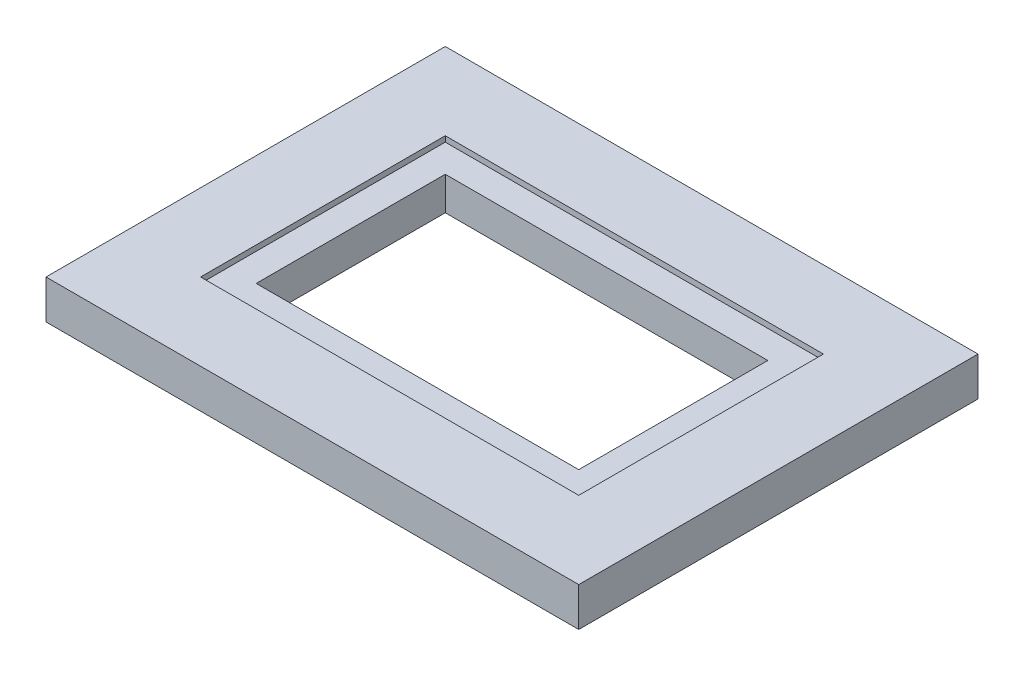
ISO-10303-21;
HEADER;
FILE_DESCRIPTION(('STEP AP214'),'2;1');
FILE_NAME('part.step','',(''),(''),'','','');
FILE_SCHEMA(('AUTOMOTIVE_DESIGN { 1 0 10303 214 1 1 1 1 }'));
ENDSEC;
DATA;
#1=APPLICATION_CONTEXT('core data for automotive mechanical design processes');
#2=APPLICATION_PROTOCOL_DEFINITION('international standard','automotive_design',2000,#1);
#3=PRODUCT_CONTEXT('',#1,'mechanical');
#4=PRODUCT('Part','Part','',(#3));
#5=PRODUCT_RELATED_PRODUCT_CATEGORY('part','',(#4));
#6=PRODUCT_DEFINITION_FORMATION('','',#4);
#7=PRODUCT_DEFINITION_CONTEXT('part definition',#1,'design');
#8=PRODUCT_DEFINITION('design','',#6,#7);
#9=PRODUCT_DEFINITION_SHAPE('','',#8);
#10=(LENGTH_UNIT() NAMED_UNIT(*) SI_UNIT(.MILLI.,.METRE.));
#11=(NAMED_UNIT(*) PLANE_ANGLE_UNIT() SI_UNIT($,.RADIAN.));
#12=(NAMED_UNIT(*) SI_UNIT($,.STERADIAN.) SOLID_ANGLE_UNIT());
#13=UNCERTAINTY_MEASURE_WITH_UNIT(LENGTH_MEASURE(1.E-05),#10,'distance_accuracy_value','');
#14=(GEOMETRIC_REPRESENTATION_CONTEXT(3) GLOBAL_UNCERTAINTY_ASSIGNED_CONTEXT((#13)) GLOBAL_UNIT_ASSIGNED_CONTEXT((#10,
#11,#12)) REPRESENTATION_CONTEXT('',''));
#15=CARTESIAN_POINT('',(0.,0.,0.));
#16=DIRECTION('',(0.,0.,1.));
#17=DIRECTION('',(1.,0.,0.));
#18=AXIS2_PLACEMENT_3D('',#15,#16,#17);
#19=CARTESIAN_POINT('',(0.,19.05,0.));
#20=DIRECTION('',(0.,1.,0.));
#21=DIRECTION('',(0.,0.,1.));
#22=AXIS2_PLACEMENT_3D('',#19,#20,#21);
#23=PLANE('',#22);
#24=DIRECTION('',(0.,0.,-1.));
#25=VECTOR('',#24,1.);
#26=CARTESIAN_POINT('',(-107.95,19.05,-69.85));
#27=LINE('',#26,#25);
#28=CARTESIAN_POINT('',(-107.95,19.05,69.85));
#29=VERTEX_POINT('',#28);
#30=CARTESIAN_POINT('',(-107.95,19.05,-69.85));
#31=VERTEX_POINT('',#30);
#32=EDGE_CURVE('E49',#29,#31,#27,.T.);
#33=ORIENTED_EDGE('',*,*,#32,.F.);
#34=DIRECTION('',(-1.,0.,0.));
#35=VECTOR('',#34,1.);
#36=CARTESIAN_POINT('',(-107.95,19.05,69.85));
#37=LINE('',#36,#35);
#38=CARTESIAN_POINT('',(107.95,19.05,69.85));
#39=VERTEX_POINT('',#38);
#40=EDGE_CURVE('E53',#39,#29,#37,.T.);
#41=ORIENTED_EDGE('',*,*,#40,.F.);
#42=DIRECTION('',(0.,0.,1.));
#43=VECTOR('',#42,1.);
#44=CARTESIAN_POINT('',(107.95,19.05,69.85));
#45=LINE('',#44,#43);
#46=CARTESIAN_POINT('',(107.95,19.05,-69.85));
#47=VERTEX_POINT('',#46);
#48=EDGE_CURVE('E294',#47,#39,#45,.T.);
#49=ORIENTED_EDGE('',*,*,#48,.F.);
#50=DIRECTION('',(1.,0.,0.));
#51=VECTOR('',#50,1.);
#52=CARTESIAN_POINT('',(107.95,19.05,-69.85));
#53=LINE('',#52,#51);
#54=EDGE_CURVE('E165',#31,#47,#53,.T.);
#55=ORIENTED_EDGE('',*,*,#54,.F.);
#56=EDGE_LOOP('',(#33,#41,#49,#55));
#57=FACE_BOUND('',#56,.T.);
#58=DIRECTION('',(1.,0.,0.));
#59=VECTOR('',#58,1.);
#60=CARTESIAN_POINT('',(92.075,19.05,53.975));
#61=LINE('',#60,#59);
#62=CARTESIAN_POINT('',(-92.075,19.05,53.975));
#63=VERTEX_POINT('',#62);
#64=CARTESIAN_POINT('',(92.075,19.05,53.975));
#65=VERTEX_POINT('',#64);
#66=EDGE_CURVE('E168',#63,#65,#61,.T.);
#67=ORIENTED_EDGE('',*,*,#66,.F.);
#68=DIRECTION('',(0.,0.,1.));
#69=VECTOR('',#68,1.);
#70=CARTESIAN_POINT('',(-92.075,19.05,53.975));
#71=LINE('',#70,#69);
#72=CARTESIAN_POINT('',(-92.075,19.05,-53.975));
#73=VERTEX_POINT('',#72);
#74=EDGE_CURVE('E166',#73,#63,#71,.T.);
#75=ORIENTED_EDGE('',*,*,#74,.F.);
#76=DIRECTION('',(-1.,0.,0.));
#77=VECTOR('',#76,1.);
#78=CARTESIAN_POINT('',(92.075,19.05,-53.975));
#79=LINE('',#78,#77);
#80=CARTESIAN_POINT('',(92.075,19.05,-53.975));
#81=VERTEX_POINT('',#80);
#82=EDGE_CURVE('E174',#81,#73,#79,.T.);
#83=ORIENTED_EDGE('',*,*,#82,.F.);
#84=DIRECTION('',(0.,0.,-1.));
#85=VECTOR('',#84,1.);
#86=CARTESIAN_POINT('',(92.075,19.05,53.975));
#87=LINE('',#86,#85);
#88=EDGE_CURVE('E171',#65,#81,#87,.T.);
#89=ORIENTED_EDGE('',*,*,#88,.F.);
#90=EDGE_LOOP('',(#67,#75,#83,#89));
#91=FACE_BOUND('',#90,.T.);
#92=ADVANCED_FACE('F34',(#57,#91),#23,.T.);
#93=CARTESIAN_POINT('',(0.,0.,0.));
#94=DIRECTION('',(0.,1.,0.));
#95=DIRECTION('',(0.,0.,1.));
#96=AXIS2_PLACEMENT_3D('',#93,#94,#95);
#97=PLANE('',#96);
#98=DIRECTION('',(0.,0.,1.));
#99=VECTOR('',#98,1.);
#100=CARTESIAN_POINT('',(-152.075,0.,113.975));
#101=LINE('',#100,#99);
#102=CARTESIAN_POINT('',(-152.075,0.,-113.975));
#103=VERTEX_POINT('',#102);
#104=CARTESIAN_POINT('',(-152.075,0.,113.975));
#105=VERTEX_POINT('',#104);
#106=EDGE_CURVE('E197',#103,#105,#101,.T.);
#107=ORIENTED_EDGE('',*,*,#106,.F.);
#108=DIRECTION('',(-1.,0.,0.));
#109=VECTOR('',#108,1.);
#110=CARTESIAN_POINT('',(152.075,0.,-113.975));
#111=LINE('',#110,#109);
#112=CARTESIAN_POINT('',(152.075,0.,-113.975));
#113=VERTEX_POINT('',#112);
#114=EDGE_CURVE('E204',#113,#103,#111,.T.);
#115=ORIENTED_EDGE('',*,*,#114,.F.);
#116=DIRECTION('',(0.,0.,-1.));
#117=VECTOR('',#116,1.);
#118=CARTESIAN_POINT('',(152.075,0.,113.975));
#119=LINE('',#118,#117);
#120=CARTESIAN_POINT('',(152.075,0.,113.975));
#121=VERTEX_POINT('',#120);
#122=EDGE_CURVE('E202',#121,#113,#119,.T.);
#123=ORIENTED_EDGE('',*,*,#122,.F.);
#124=DIRECTION('',(1.,0.,0.));
#125=VECTOR('',#124,1.);
#126=CARTESIAN_POINT('',(152.075,0.,113.975));
#127=LINE('',#126,#125);
#128=EDGE_CURVE('E200',#105,#121,#127,.T.);
#129=ORIENTED_EDGE('',*,*,#128,.F.);
#130=EDGE_LOOP('',(#107,#115,#123,#129));
#131=FACE_BOUND('',#130,.T.);
#132=DIRECTION('',(0.,0.,1.));
#133=VECTOR('',#132,1.);
#134=CARTESIAN_POINT('',(-92.075,0.,53.975));
#135=LINE('',#134,#133);
#136=CARTESIAN_POINT('',(-92.075,0.,-53.975));
#137=VERTEX_POINT('',#136);
#138=CARTESIAN_POINT('',(-92.075,0.,53.975));
#139=VERTEX_POINT('',#138);
#140=EDGE_CURVE('E177',#137,#139,#135,.T.);
#141=ORIENTED_EDGE('',*,*,#140,.T.);
#142=DIRECTION('',(1.,0.,0.));
#143=VECTOR('',#142,1.);
#144=CARTESIAN_POINT('',(92.075,0.,53.975));
#145=LINE('',#144,#143);
#146=CARTESIAN_POINT('',(92.075,0.,53.975));
#147=VERTEX_POINT('',#146);
#148=EDGE_CURVE('E180',#139,#147,#145,.T.);
#149=ORIENTED_EDGE('',*,*,#148,.T.);
#150=DIRECTION('',(0.,0.,-1.));
#151=VECTOR('',#150,1.);
#152=CARTESIAN_POINT('',(92.075,0.,53.975));
#153=LINE('',#152,#151);
#154=CARTESIAN_POINT('',(92.075,0.,-53.9750000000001));
#155=VERTEX_POINT('',#154);
#156=EDGE_CURVE('E183',#147,#155,#153,.T.);
#157=ORIENTED_EDGE('',*,*,#156,.T.);
#158=DIRECTION('',(-1.,0.,0.));
#159=VECTOR('',#158,1.);
#160=CARTESIAN_POINT('',(92.075,0.,-53.9750000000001));
#161=LINE('',#160,#159);
#162=EDGE_CURVE('E169',#155,#137,#161,.T.);
#163=ORIENTED_EDGE('',*,*,#162,.T.);
#164=EDGE_LOOP('',(#141,#149,#157,#163));
#165=FACE_BOUND('',#164,.T.);
#166=ADVANCED_FACE('F221',(#131,#165),#97,.F.);
#167=CARTESIAN_POINT('',(-152.075,19.05,113.975));
#168=DIRECTION('',(1.,0.,0.));
#169=DIRECTION('',(0.,0.,-1.));
#170=AXIS2_PLACEMENT_3D('',#167,#168,#169);
#171=PLANE('',#170);
#172=ORIENTED_EDGE('',*,*,#106,.T.);
#173=DIRECTION('',(0.,-1.,0.));
#174=VECTOR('',#173,1.);
#175=CARTESIAN_POINT('',(-152.075,19.05,113.975));
#176=LINE('',#175,#174);
#177=CARTESIAN_POINT('',(-152.075,22.23,113.975));
#178=VERTEX_POINT('',#177);
#179=EDGE_CURVE('E11',#178,#105,#176,.T.);
#180=ORIENTED_EDGE('',*,*,#179,.F.);
#181=DIRECTION('',(0.,0.,1.));
#182=VECTOR('',#181,1.);
#183=CARTESIAN_POINT('',(-152.075,22.23,-113.975));
#184=LINE('',#183,#182);
#185=CARTESIAN_POINT('',(-152.075,22.23,-113.975));
#186=VERTEX_POINT('',#185);
#187=EDGE_CURVE('E155',#186,#178,#184,.T.);
#188=ORIENTED_EDGE('',*,*,#187,.F.);
#189=DIRECTION('',(0.,-1.,0.));
#190=VECTOR('',#189,1.);
#191=CARTESIAN_POINT('',(-152.075,19.05,-113.975));
#192=LINE('',#191,#190);
#193=EDGE_CURVE('E206',#186,#103,#192,.T.);
#194=ORIENTED_EDGE('',*,*,#193,.T.);
#195=EDGE_LOOP('',(#172,#180,#188,#194));
#196=FACE_BOUND('',#195,.T.);
#197=ADVANCED_FACE('F36',(#196),#171,.F.);
#198=CARTESIAN_POINT('',(152.075,19.05,113.975));
#199=DIRECTION('',(0.,0.,-1.));
#200=DIRECTION('',(-1.,0.,0.));
#201=AXIS2_PLACEMENT_3D('',#198,#199,#200);
#202=PLANE('',#201);
#203=ORIENTED_EDGE('',*,*,#128,.T.);
#204=DIRECTION('',(0.,-1.,0.));
#205=VECTOR('',#204,1.);
#206=CARTESIAN_POINT('',(152.075,19.05,113.975));
#207=LINE('',#206,#205);
#208=CARTESIAN_POINT('',(152.075,22.23,113.975));
#209=VERTEX_POINT('',#208);
#210=EDGE_CURVE('E42',#209,#121,#207,.T.);
#211=ORIENTED_EDGE('',*,*,#210,.F.);
#212=DIRECTION('',(1.,0.,0.));
#213=VECTOR('',#212,1.);
#214=CARTESIAN_POINT('',(-152.075,22.23,113.975));
#215=LINE('',#214,#213);
#216=EDGE_CURVE('E158',#178,#209,#215,.T.);
#217=ORIENTED_EDGE('',*,*,#216,.F.);
#218=ORIENTED_EDGE('',*,*,#179,.T.);
#219=EDGE_LOOP('',(#203,#211,#217,#218));
#220=FACE_BOUND('',#219,.T.);
#221=ADVANCED_FACE('F228',(#220),#202,.F.);
#222=CARTESIAN_POINT('',(152.075,19.05,113.975));
#223=DIRECTION('',(-1.,0.,0.));
#224=DIRECTION('',(0.,0.,1.));
#225=AXIS2_PLACEMENT_3D('',#222,#223,#224);
#226=PLANE('',#225);
#227=ORIENTED_EDGE('',*,*,#122,.T.);
#228=DIRECTION('',(0.,-1.,0.));
#229=VECTOR('',#228,1.);
#230=CARTESIAN_POINT('',(152.075,19.05,-113.975));
#231=LINE('',#230,#229);
#232=CARTESIAN_POINT('',(152.075,22.23,-113.975));
#233=VERTEX_POINT('',#232);
#234=EDGE_CURVE('E209',#233,#113,#231,.T.);
#235=ORIENTED_EDGE('',*,*,#234,.F.);
#236=DIRECTION('',(0.,0.,-1.));
#237=VECTOR('',#236,1.);
#238=CARTESIAN_POINT('',(152.075,22.23,113.975));
#239=LINE('',#238,#237);
#240=EDGE_CURVE('E161',#209,#233,#239,.T.);
#241=ORIENTED_EDGE('',*,*,#240,.F.);
#242=ORIENTED_EDGE('',*,*,#210,.T.);
#243=EDGE_LOOP('',(#227,#235,#241,#242));
#244=FACE_BOUND('',#243,.T.);
#245=ADVANCED_FACE('F215',(#244),#226,.F.);
#246=CARTESIAN_POINT('',(152.075,19.05,-113.975));
#247=DIRECTION('',(0.,0.,1.));
#248=DIRECTION('',(1.,0.,0.));
#249=AXIS2_PLACEMENT_3D('',#246,#247,#248);
#250=PLANE('',#249);
#251=ORIENTED_EDGE('',*,*,#114,.T.);
#252=ORIENTED_EDGE('',*,*,#193,.F.);
#253=DIRECTION('',(-1.,0.,0.));
#254=VECTOR('',#253,1.);
#255=CARTESIAN_POINT('',(152.075,22.23,-113.975));
#256=LINE('',#255,#254);
#257=EDGE_CURVE('E150',#233,#186,#256,.T.);
#258=ORIENTED_EDGE('',*,*,#257,.F.);
#259=ORIENTED_EDGE('',*,*,#234,.T.);
#260=EDGE_LOOP('',(#251,#252,#258,#259));
#261=FACE_BOUND('',#260,.T.);
#262=ADVANCED_FACE('F224',(#261),#250,.F.);
#263=CARTESIAN_POINT('',(-92.075,19.05,53.975));
#264=DIRECTION('',(1.,0.,0.));
#265=DIRECTION('',(0.,0.,-1.));
#266=AXIS2_PLACEMENT_3D('',#263,#264,#265);
#267=PLANE('',#266);
#268=ORIENTED_EDGE('',*,*,#140,.F.);
#269=DIRECTION('',(0.,-1.,0.));
#270=VECTOR('',#269,1.);
#271=CARTESIAN_POINT('',(-92.075,19.05,-53.975));
#272=LINE('',#271,#270);
#273=EDGE_CURVE('E176',#73,#137,#272,.T.);
#274=ORIENTED_EDGE('',*,*,#273,.F.);
#275=ORIENTED_EDGE('',*,*,#74,.T.);
#276=DIRECTION('',(0.,-1.,0.));
#277=VECTOR('',#276,1.);
#278=CARTESIAN_POINT('',(-92.075,19.05,53.975));
#279=LINE('',#278,#277);
#280=EDGE_CURVE('E194',#63,#139,#279,.T.);
#281=ORIENTED_EDGE('',*,*,#280,.T.);
#282=EDGE_LOOP('',(#268,#274,#275,#281));
#283=FACE_BOUND('',#282,.T.);
#284=ADVANCED_FACE('F243',(#283),#267,.T.);
#285=CARTESIAN_POINT('',(92.075,19.05,53.975));
#286=DIRECTION('',(0.,0.,-1.));
#287=DIRECTION('',(-1.,0.,0.));
#288=AXIS2_PLACEMENT_3D('',#285,#286,#287);
#289=PLANE('',#288);
#290=ORIENTED_EDGE('',*,*,#148,.F.);
#291=ORIENTED_EDGE('',*,*,#280,.F.);
#292=ORIENTED_EDGE('',*,*,#66,.T.);
#293=DIRECTION('',(0.,-1.,0.));
#294=VECTOR('',#293,1.);
#295=CARTESIAN_POINT('',(92.075,19.05,53.975));
#296=LINE('',#295,#294);
#297=EDGE_CURVE('E192',#65,#147,#296,.T.);
#298=ORIENTED_EDGE('',*,*,#297,.T.);
#299=EDGE_LOOP('',(#290,#291,#292,#298));
#300=FACE_BOUND('',#299,.T.);
#301=ADVANCED_FACE('F250',(#300),#289,.T.);
#302=CARTESIAN_POINT('',(92.075,19.05,53.975));
#303=DIRECTION('',(-1.,0.,0.));
#304=DIRECTION('',(0.,0.,1.));
#305=AXIS2_PLACEMENT_3D('',#302,#303,#304);
#306=PLANE('',#305);
#307=ORIENTED_EDGE('',*,*,#156,.F.);
#308=ORIENTED_EDGE('',*,*,#297,.F.);
#309=ORIENTED_EDGE('',*,*,#88,.T.);
#310=DIRECTION('',(0.,-1.,0.));
#311=VECTOR('',#310,1.);
#312=CARTESIAN_POINT('',(92.075,19.05,-53.975));
#313=LINE('',#312,#311);
#314=EDGE_CURVE('E190',#81,#155,#313,.T.);
#315=ORIENTED_EDGE('',*,*,#314,.T.);
#316=EDGE_LOOP('',(#307,#308,#309,#315));
#317=FACE_BOUND('',#316,.T.);
#318=ADVANCED_FACE('F255',(#317),#306,.T.);
#319=CARTESIAN_POINT('',(92.075,19.05,-53.975));
#320=DIRECTION('',(0.,0.,1.));
#321=DIRECTION('',(1.,0.,0.));
#322=AXIS2_PLACEMENT_3D('',#319,#320,#321);
#323=PLANE('',#322);
#324=ORIENTED_EDGE('',*,*,#162,.F.);
#325=ORIENTED_EDGE('',*,*,#314,.F.);
#326=ORIENTED_EDGE('',*,*,#82,.T.);
#327=ORIENTED_EDGE('',*,*,#273,.T.);
#328=EDGE_LOOP('',(#324,#325,#326,#327));
#329=FACE_BOUND('',#328,.T.);
#330=ADVANCED_FACE('F262',(#329),#323,.T.);
#331=CARTESIAN_POINT('',(0.,22.23,0.));
#332=DIRECTION('',(0.,1.,0.));
#333=DIRECTION('',(0.,0.,1.));
#334=AXIS2_PLACEMENT_3D('',#331,#332,#333);
#335=PLANE('',#334);
#336=DIRECTION('',(-1.,0.,0.));
#337=VECTOR('',#336,1.);
#338=CARTESIAN_POINT('',(107.95,22.23,-69.85));
#339=LINE('',#338,#337);
#340=CARTESIAN_POINT('',(107.95,22.23,-69.85));
#341=VERTEX_POINT('',#340);
#342=CARTESIAN_POINT('',(-107.95,22.23,-69.85));
#343=VERTEX_POINT('',#342);
#344=EDGE_CURVE('E138',#341,#343,#339,.T.);
#345=ORIENTED_EDGE('',*,*,#344,.F.);
#346=DIRECTION('',(0.,0.,-1.));
#347=VECTOR('',#346,1.);
#348=CARTESIAN_POINT('',(107.95,22.23,69.85));
#349=LINE('',#348,#347);
#350=CARTESIAN_POINT('',(107.95,22.23,69.85));
#351=VERTEX_POINT('',#350);
#352=EDGE_CURVE('E143',#351,#341,#349,.T.);
#353=ORIENTED_EDGE('',*,*,#352,.F.);
#354=DIRECTION('',(1.,0.,0.));
#355=VECTOR('',#354,1.);
#356=CARTESIAN_POINT('',(-107.95,22.23,69.85));
#357=LINE('',#356,#355);
#358=CARTESIAN_POINT('',(-107.95,22.23,69.85));
#359=VERTEX_POINT('',#358);
#360=EDGE_CURVE('E125',#359,#351,#357,.T.);
#361=ORIENTED_EDGE('',*,*,#360,.F.);
#362=DIRECTION('',(0.,0.,1.));
#363=VECTOR('',#362,1.);
#364=CARTESIAN_POINT('',(-107.95,22.23,-69.85));
#365=LINE('',#364,#363);
#366=EDGE_CURVE('E132',#343,#359,#365,.T.);
#367=ORIENTED_EDGE('',*,*,#366,.F.);
#368=EDGE_LOOP('',(#345,#353,#361,#367));
#369=FACE_BOUND('',#368,.T.);
#370=ORIENTED_EDGE('',*,*,#257,.T.);
#371=ORIENTED_EDGE('',*,*,#187,.T.);
#372=ORIENTED_EDGE('',*,*,#216,.T.);
#373=ORIENTED_EDGE('',*,*,#240,.T.);
#374=EDGE_LOOP('',(#370,#371,#372,#373));
#375=FACE_BOUND('',#374,.T.);
#376=ADVANCED_FACE('F140',(#369,#375),#335,.T.);
#377=CARTESIAN_POINT('',(-107.95,-361.040022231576,-69.85));
#378=DIRECTION('',(-1.,0.,0.));
#379=DIRECTION('',(0.,0.,1.));
#380=AXIS2_PLACEMENT_3D('',#377,#378,#379);
#381=PLANE('',#380);
#382=DIRECTION('',(0.,1.,0.));
#383=VECTOR('',#382,1.);
#384=CARTESIAN_POINT('',(-107.95,-361.040022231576,69.85));
#385=LINE('',#384,#383);
#386=EDGE_CURVE('E121',#29,#359,#385,.T.);
#387=ORIENTED_EDGE('',*,*,#386,.F.);
#388=ORIENTED_EDGE('',*,*,#32,.T.);
#389=DIRECTION('',(0.,1.,0.));
#390=VECTOR('',#389,1.);
#391=CARTESIAN_POINT('',(-107.95,-361.040022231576,-69.85));
#392=LINE('',#391,#390);
#393=EDGE_CURVE('E129',#31,#343,#392,.T.);
#394=ORIENTED_EDGE('',*,*,#393,.T.);
#395=ORIENTED_EDGE('',*,*,#366,.T.);
#396=EDGE_LOOP('',(#387,#388,#394,#395));
#397=FACE_BOUND('',#396,.T.);
#398=ADVANCED_FACE('F133',(#397),#381,.F.);
#399=CARTESIAN_POINT('',(-107.95,-361.040022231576,69.85));
#400=DIRECTION('',(0.,0.,1.));
#401=DIRECTION('',(1.,0.,0.));
#402=AXIS2_PLACEMENT_3D('',#399,#400,#401);
#403=PLANE('',#402);
#404=DIRECTION('',(0.,1.,0.));
#405=VECTOR('',#404,1.);
#406=CARTESIAN_POINT('',(107.95,-361.040022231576,69.85));
#407=LINE('',#406,#405);
#408=EDGE_CURVE('E128',#39,#351,#407,.T.);
#409=ORIENTED_EDGE('',*,*,#408,.F.);
#410=ORIENTED_EDGE('',*,*,#40,.T.);
#411=ORIENTED_EDGE('',*,*,#386,.T.);
#412=ORIENTED_EDGE('',*,*,#360,.T.);
#413=EDGE_LOOP('',(#409,#410,#411,#412));
#414=FACE_BOUND('',#413,.T.);
#415=ADVANCED_FACE('F123',(#414),#403,.F.);
#416=CARTESIAN_POINT('',(107.95,-361.040022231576,69.85));
#417=DIRECTION('',(1.,0.,0.));
#418=DIRECTION('',(0.,0.,-1.));
#419=AXIS2_PLACEMENT_3D('',#416,#417,#418);
#420=PLANE('',#419);
#421=DIRECTION('',(0.,1.,0.));
#422=VECTOR('',#421,1.);
#423=CARTESIAN_POINT('',(107.95,-361.040022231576,-69.85));
#424=LINE('',#423,#422);
#425=EDGE_CURVE('E148',#47,#341,#424,.T.);
#426=ORIENTED_EDGE('',*,*,#425,.F.);
#427=ORIENTED_EDGE('',*,*,#48,.T.);
#428=ORIENTED_EDGE('',*,*,#408,.T.);
#429=ORIENTED_EDGE('',*,*,#352,.T.);
#430=EDGE_LOOP('',(#426,#427,#428,#429));
#431=FACE_BOUND('',#430,.T.);
#432=ADVANCED_FACE('F281',(#431),#420,.F.);
#433=CARTESIAN_POINT('',(107.95,-361.040022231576,-69.85));
#434=DIRECTION('',(0.,0.,-1.));
#435=DIRECTION('',(-1.,0.,0.));
#436=AXIS2_PLACEMENT_3D('',#433,#434,#435);
#437=PLANE('',#436);
#438=ORIENTED_EDGE('',*,*,#393,.F.);
#439=ORIENTED_EDGE('',*,*,#54,.T.);
#440=ORIENTED_EDGE('',*,*,#425,.T.);
#441=ORIENTED_EDGE('',*,*,#344,.T.);
#442=EDGE_LOOP('',(#438,#439,#440,#441));
#443=FACE_BOUND('',#442,.T.);
#444=ADVANCED_FACE('F278',(#443),#437,.F.);
#445=CLOSED_SHELL('',(#92,#166,#197,#221,#245,#262,#284,#301,#318,#330,#376,#398,#415,#432,#444));
#446=MANIFOLD_SOLID_BREP('B2',#445);
#447=ADVANCED_BREP_SHAPE_REPRESENTATION('',(#18,#446),#14);
#448=SHAPE_DEFINITION_REPRESENTATION(#9,#447);
ENDSEC;
END-ISO-10303-21;
